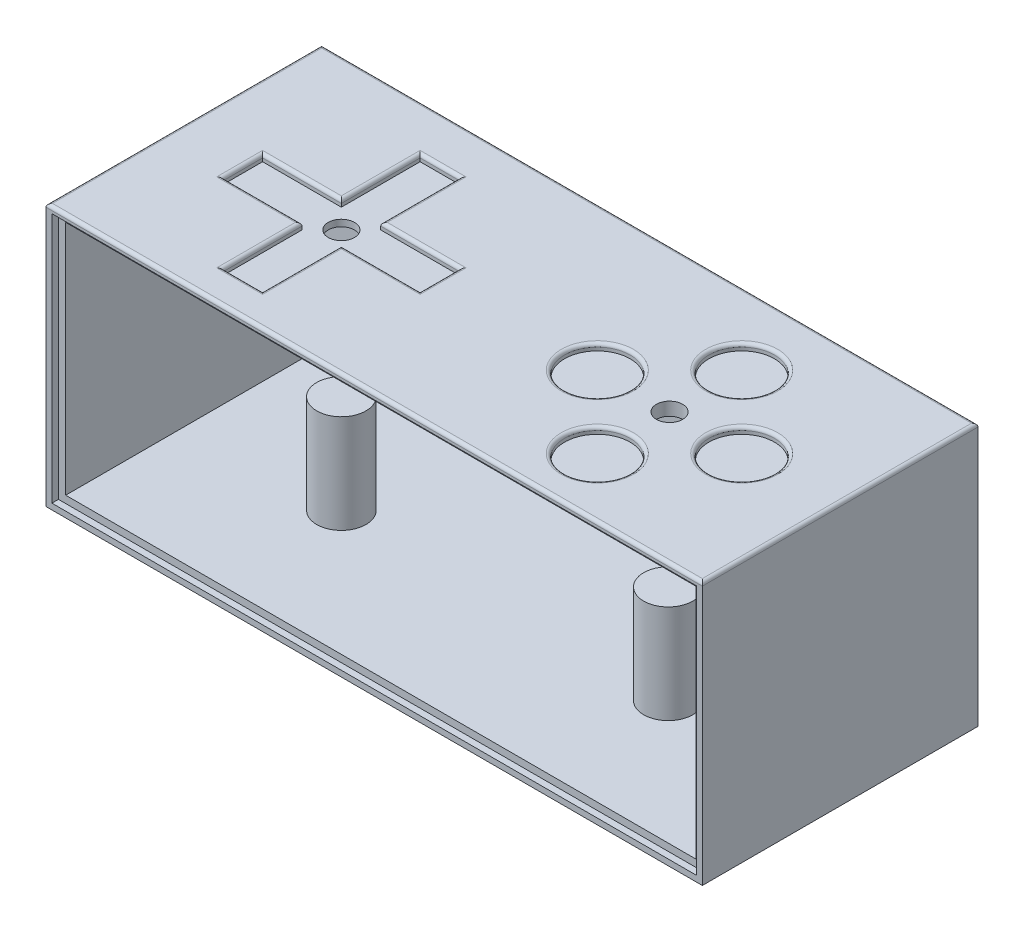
from build123d import *

# Parameters (mm, degrees)
SKIZZE1_W                       = 200
SKIZZE1_H                       = 80
AUFSATZ_LINEAR_AUSTRAGEN1_DEPTH = 4
SKIZZE2_W                       = 200
SKIZZE2_H                       = 80
SKIZZE2_W_2                     = 192
SKIZZE2_H_2                     = 72
AUFSATZ_LINEAR_AUSTRAGEN2_DEPTH = 80
SKIZZE3_W                       = 196.4
SKIZZE3_H                       = 76.4
SCHNITT_LINEAR_AUSTRAGEN1_DEPTH = 2
SKIZZE4_W                       = 24
SKIZZE4_H                       = 12
SKIZZE4_W_2                     = 12
SKIZZE4_H_2                     = 24
SKIZZE4_R                       = 4
SKIZZE4_R_2                     = 10
SCHNITT_LINEAR_AUSTRAGEN2_DEPTH = 2
VERRUNDUNG1_R                   = 1
SKIZZE5_R                       = 4
SCHNITT_LINEAR_AUSTRAGEN3_DEPTH = 15
SKIZZE6_R                       = 6
SCHNITT_LINEAR_AUSTRAGEN4_DEPTH = 15
AUFSATZ_LINEAR_START            = -46
SKIZZE7_R                       = 7.5
AUFSATZ_LINEAR_AUSTRAGEN3_DEPTH = 30


with BuildPart() as part:
    # Skizze1 → Aufsatz-Linear austragen1 (new body)
    with BuildSketch(Plane.XY):
        Rectangle(SKIZZE1_W, SKIZZE1_H)
    extrude(amount=AUFSATZ_LINEAR_AUSTRAGEN1_DEPTH)

    # Skizze2 → Aufsatz-Linear austragen2 (add)
    with BuildSketch(Plane.XY.offset(4)):
        Rectangle(SKIZZE2_W, SKIZZE2_H)
        Rectangle(SKIZZE2_W_2, SKIZZE2_H_2, mode=Mode.SUBTRACT)
    extrude(amount=AUFSATZ_LINEAR_AUSTRAGEN2_DEPTH)

    # Skizze3 → Schnitt-Linear austragen1 (cut)
    with BuildSketch(Plane.XY.offset(84)):
        Rectangle(SKIZZE3_W, SKIZZE3_H)
    extrude(amount=-SCHNITT_LINEAR_AUSTRAGEN1_DEPTH, mode=Mode.SUBTRACT)

    # Skizze4 → Schnitt-Linear austragen2 (cut)
    # profile 1 of 9: a face of its own
    with BuildSketch(Plane(origin=(0, 40, 0), x_dir=(1, 0, 0), z_dir=(0, 1, 0))):
        with Locations((-68, -44)):
            Rectangle(SKIZZE4_W, SKIZZE4_H)
    # profile 2 of 9: a face of its own
    with BuildSketch(Plane(origin=(0, 40, 0), x_dir=(1, 0, 0), z_dir=(0, 1, 0))):
        with Locations((-50, -26)):
            Rectangle(SKIZZE4_W_2, SKIZZE4_H_2)
    # profile 3 of 9: a face of its own
    with BuildSketch(Plane(origin=(0, 40, 0), x_dir=(1, 0, 0), z_dir=(0, 1, 0))):
        with Locations((-32, -44)):
            Rectangle(SKIZZE4_W, SKIZZE4_H)
    # profile 4 of 9: a face of its own
    with BuildSketch(Plane(origin=(0, 40, 0), x_dir=(1, 0, 0), z_dir=(0, 1, 0))):
        with Locations((-50, -44)):
            Rectangle(SKIZZE4_W_2, SKIZZE4_H)
        with Locations(Location((-50, -44, 0), (0, 0, 270))):
            Circle(SKIZZE4_R, mode=Mode.SUBTRACT)
    # profile 5 of 9: a face of its own
    with BuildSketch(Plane(origin=(0, 40, 0), x_dir=(1, 0, 0), z_dir=(0, 1, 0))):
        with Locations((-50, -62)):
            Rectangle(SKIZZE4_W_2, SKIZZE4_H_2)
    # profile 6 of 9: a face of its own
    with BuildSketch(Plane(origin=(0, 40, 0), x_dir=(1, 0, 0), z_dir=(0, 1, 0))):
        with Locations(Location((50, -66, 0), (0, 0, 270))):
            Circle(SKIZZE4_R_2)
    # profile 7 of 9: a face of its own
    with BuildSketch(Plane(origin=(0, 40, 0), x_dir=(1, 0, 0), z_dir=(0, 1, 0))):
        with Locations(Location((28, -44, 0), (0, 0, 270))):
            Circle(SKIZZE4_R_2)
    # profile 8 of 9: a face of its own
    with BuildSketch(Plane(origin=(0, 40, 0), x_dir=(1, 0, 0), z_dir=(0, 1, 0))):
        with Locations(Location((50, -22, 0), (0, 0, 270))):
            Circle(SKIZZE4_R_2)
    # profile 9 of 9: a face of its own
    with BuildSketch(Plane(origin=(0, 40, 0), x_dir=(1, 0, 0), z_dir=(0, 1, 0))):
        with Locations(Location((72, -44, 0), (0, 0, 270))):
            Circle(SKIZZE4_R_2)
    extrude(amount=-SCHNITT_LINEAR_AUSTRAGEN2_DEPTH, mode=Mode.SUBTRACT)

    # Verrundung1
    verrundung1_edges = [part.edges().sort_by_distance(p)[0] for p in [
        (0, 40, 84),
        (0, 40, 0),
        (-80, 40, 44),
        (-68, 40, 38),
        (-56, 40, 26),
        (-50, 40, 14),
        (-32, 40, 38),
        (-56, 40, 62),
        (-68, 40, 50),
        (-50, 40, 74),
        (-44, 40, 62),
        (-32, 40, 50),
        (-20, 40, 44),
        (-44, 40, 26),
        (-100, 40, 42),
        (100, 40, 42),
        (72, 40, 34),
        (50, 40, 12),
        (28, 40, 34),
        (50, 40, 56),
    ]]
    fillet(verrundung1_edges, radius=VERRUNDUNG1_R)

    # Skizze5 → Schnitt-Linear austragen3 (cut)
    with BuildSketch(Plane(origin=(0, 40, 0), x_dir=(1, 0, 0), z_dir=(0, 1, 0))):
        with Locations(Location((-50, -44, 0), (0, 0, 270))):
            Circle(SKIZZE5_R)
        with Locations(Location((50, -44, 0), (0, 0, 270))):
            Circle(SKIZZE5_R)
    extrude(amount=-SCHNITT_LINEAR_AUSTRAGEN3_DEPTH, mode=Mode.SUBTRACT)

    # Skizze6 → Schnitt-Linear austragen4 (cut)
    with BuildSketch(Plane(origin=(0, 0, 0), x_dir=(-1, 0, 0), z_dir=(0, 0, -1))):
        with Locations((0, -30)):
            Circle(SKIZZE6_R)
    extrude(amount=-SCHNITT_LINEAR_AUSTRAGEN4_DEPTH, mode=Mode.SUBTRACT)

    # Skizze7 → Aufsatz-Linear austragen3 (add)
    with BuildSketch(Plane(origin=(0, 40, 0), x_dir=(1, 0, 0), z_dir=(0, 1, 0)).offset(AUFSATZ_LINEAR_START)):
        with Locations(Location((-50, -44, 0), (0, 0, 270))):
            Circle(SKIZZE7_R)
        with Locations(Location((50, -44.383101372, 0), (0, 0, 270))):
            Circle(SKIZZE7_R)
    extrude(amount=-AUFSATZ_LINEAR_AUSTRAGEN3_DEPTH)


solid = part.part
